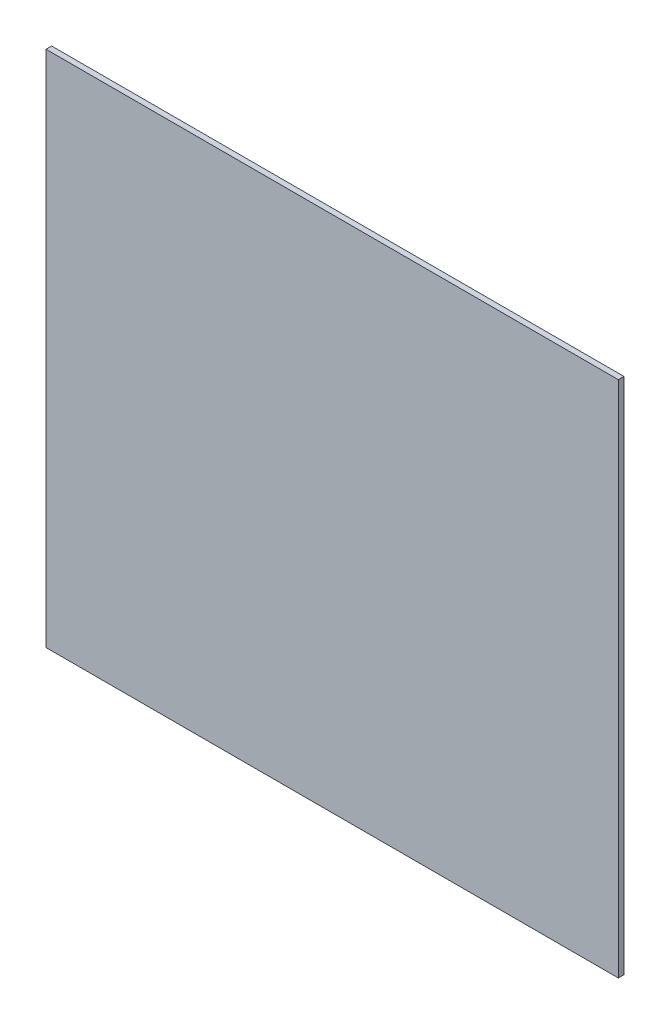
from build123d import *

# Parameters (mm, degrees)
SKIZZE1_W               = 1015
SKIZZE1_H               = 919
LINEAR_AUSTRAGEN1_DEPTH = 10


with BuildPart() as part:
    # Skizze1 → Linear austragen1 (new body)
    with BuildSketch(Plane.XY):
        with Locations((-1030.352943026, -242.346010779)):
            Rectangle(SKIZZE1_W, SKIZZE1_H)
    extrude(amount=LINEAR_AUSTRAGEN1_DEPTH)


solid = part.part
